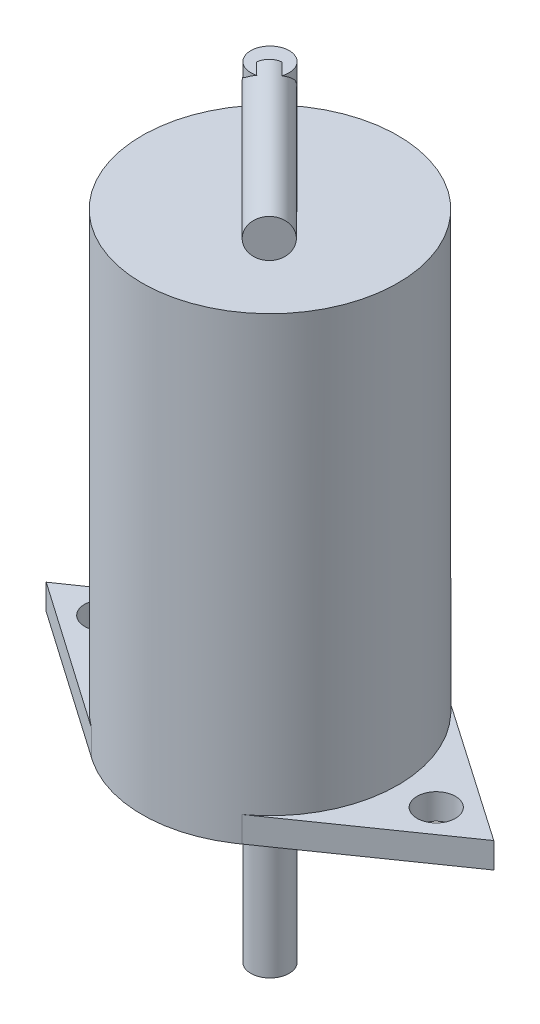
ISO-10303-21;
HEADER;
FILE_DESCRIPTION(('STEP AP214'),'2;1');
FILE_NAME('part.step','',(''),(''),'','','');
FILE_SCHEMA(('AUTOMOTIVE_DESIGN { 1 0 10303 214 1 1 1 1 }'));
ENDSEC;
DATA;
#1=APPLICATION_CONTEXT('core data for automotive mechanical design processes');
#2=APPLICATION_PROTOCOL_DEFINITION('international standard','automotive_design',2000,#1);
#3=PRODUCT_CONTEXT('',#1,'mechanical');
#4=PRODUCT('Part','Part','',(#3));
#5=PRODUCT_RELATED_PRODUCT_CATEGORY('part','',(#4));
#6=PRODUCT_DEFINITION_FORMATION('','',#4);
#7=PRODUCT_DEFINITION_CONTEXT('part definition',#1,'design');
#8=PRODUCT_DEFINITION('design','',#6,#7);
#9=PRODUCT_DEFINITION_SHAPE('','',#8);
#10=(LENGTH_UNIT() NAMED_UNIT(*) SI_UNIT(.MILLI.,.METRE.));
#11=(NAMED_UNIT(*) PLANE_ANGLE_UNIT() SI_UNIT($,.RADIAN.));
#12=(NAMED_UNIT(*) SI_UNIT($,.STERADIAN.) SOLID_ANGLE_UNIT());
#13=UNCERTAINTY_MEASURE_WITH_UNIT(LENGTH_MEASURE(1.E-05),#10,'distance_accuracy_value','');
#14=(GEOMETRIC_REPRESENTATION_CONTEXT(3) GLOBAL_UNCERTAINTY_ASSIGNED_CONTEXT((#13)) GLOBAL_UNIT_ASSIGNED_CONTEXT((#10,
#11,#12)) REPRESENTATION_CONTEXT('',''));
#15=CARTESIAN_POINT('',(0.,0.,0.));
#16=DIRECTION('',(0.,0.,1.));
#17=DIRECTION('',(1.,0.,0.));
#18=AXIS2_PLACEMENT_3D('',#15,#16,#17);
#19=CARTESIAN_POINT('',(0.,36.,0.));
#20=DIRECTION('',(0.,-1.,0.));
#21=DIRECTION('',(0.,0.,-1.));
#22=AXIS2_PLACEMENT_3D('',#19,#20,#21);
#23=CYLINDRICAL_SURFACE('',#22,10.);
#24=CARTESIAN_POINT('',(0.,2.,0.));
#25=DIRECTION('',(0.,-1.,0.));
#26=DIRECTION('',(0.,0.,-1.));
#27=AXIS2_PLACEMENT_3D('',#24,#25,#26);
#28=CIRCLE('',#27,10.);
#29=CARTESIAN_POINT('',(-5.89041679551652,2.,8.08102654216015));
#30=VERTEX_POINT('',#29);
#31=CARTESIAN_POINT('',(-6.43614728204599,2.,-7.65349646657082));
#32=VERTEX_POINT('',#31);
#33=EDGE_CURVE('E183',#30,#32,#28,.T.);
#34=ORIENTED_EDGE('',*,*,#33,.F.);
#35=DIRECTION('',(0.,-1.,0.));
#36=VECTOR('',#35,1.);
#37=CARTESIAN_POINT('',(-5.89041679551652,36.,8.08102654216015));
#38=LINE('',#37,#36);
#39=CARTESIAN_POINT('',(-5.89041679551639,0.,8.08102654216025));
#40=VERTEX_POINT('',#39);
#41=EDGE_CURVE('E304',#30,#40,#38,.T.);
#42=ORIENTED_EDGE('',*,*,#41,.T.);
#43=CARTESIAN_POINT('',(0.,0.,0.));
#44=DIRECTION('',(0.,1.,0.));
#45=DIRECTION('',(-0.589041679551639,0.,0.808102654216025));
#46=AXIS2_PLACEMENT_3D('',#43,#44,#45);
#47=CIRCLE('',#46,10.);
#48=CARTESIAN_POINT('',(-5.53272807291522,0.,8.33000120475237));
#49=VERTEX_POINT('',#48);
#50=EDGE_CURVE('E198',#40,#49,#47,.T.);
#51=ORIENTED_EDGE('',*,*,#50,.T.);
#52=CARTESIAN_POINT('',(0.,0.,0.));
#53=DIRECTION('',(0.,1.,0.));
#54=DIRECTION('',(0.,0.,1.));
#55=AXIS2_PLACEMENT_3D('',#52,#53,#54);
#56=CIRCLE('',#55,10.);
#57=CARTESIAN_POINT('',(5.53272807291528,0.,8.33000120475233));
#58=VERTEX_POINT('',#57);
#59=EDGE_CURVE('E281',#49,#58,#56,.T.);
#60=ORIENTED_EDGE('',*,*,#59,.T.);
#61=CARTESIAN_POINT('',(0.,0.,0.));
#62=DIRECTION('',(0.,1.,0.));
#63=DIRECTION('',(0.553272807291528,0.,0.833000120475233));
#64=AXIS2_PLACEMENT_3D('',#61,#62,#63);
#65=CIRCLE('',#64,10.);
#66=CARTESIAN_POINT('',(5.89041679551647,0.,8.08102654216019));
#67=VERTEX_POINT('',#66);
#68=EDGE_CURVE('E266',#58,#67,#65,.T.);
#69=ORIENTED_EDGE('',*,*,#68,.T.);
#70=DIRECTION('',(0.,-1.,0.));
#71=VECTOR('',#70,1.);
#72=CARTESIAN_POINT('',(5.89041679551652,36.,8.08102654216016));
#73=LINE('',#72,#71);
#74=CARTESIAN_POINT('',(5.89041679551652,2.,8.08102654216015));
#75=VERTEX_POINT('',#74);
#76=EDGE_CURVE('E306',#67,#75,#73,.F.);
#77=ORIENTED_EDGE('',*,*,#76,.T.);
#78=CARTESIAN_POINT('',(6.436147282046,2.,-7.65349646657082));
#79=VERTEX_POINT('',#78);
#80=EDGE_CURVE('E282',#79,#75,#28,.T.);
#81=ORIENTED_EDGE('',*,*,#80,.F.);
#82=DIRECTION('',(0.,-1.,0.));
#83=VECTOR('',#82,1.);
#84=CARTESIAN_POINT('',(6.43614728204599,36.,-7.65349646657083));
#85=LINE('',#84,#83);
#86=CARTESIAN_POINT('',(6.43614728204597,0.,-7.65349646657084));
#87=VERTEX_POINT('',#86);
#88=EDGE_CURVE('E319',#79,#87,#85,.T.);
#89=ORIENTED_EDGE('',*,*,#88,.T.);
#90=CARTESIAN_POINT('',(-6.43614728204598,0.,-7.65349646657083));
#91=VERTEX_POINT('',#90);
#92=EDGE_CURVE('E298',#87,#91,#56,.T.);
#93=ORIENTED_EDGE('',*,*,#92,.T.);
#94=DIRECTION('',(0.,-1.,0.));
#95=VECTOR('',#94,1.);
#96=CARTESIAN_POINT('',(-6.43614728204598,36.,-7.65349646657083));
#97=LINE('',#96,#95);
#98=EDGE_CURVE('E303',#91,#32,#97,.F.);
#99=ORIENTED_EDGE('',*,*,#98,.T.);
#100=EDGE_LOOP('',(#34,#42,#51,#60,#69,#77,#81,#89,#93,#99));
#101=FACE_BOUND('',#100,.T.);
#102=CARTESIAN_POINT('',(0.,36.,0.));
#103=DIRECTION('',(0.,1.,0.));
#104=DIRECTION('',(0.,0.,1.));
#105=AXIS2_PLACEMENT_3D('',#102,#103,#104);
#106=CIRCLE('',#105,10.);
#107=CARTESIAN_POINT('',(0.,36.,10.));
#108=VERTEX_POINT('',#107);
#109=EDGE_CURVE('E188',#108,#108,#106,.T.);
#110=ORIENTED_EDGE('',*,*,#109,.F.);
#111=EDGE_LOOP('',(#110));
#112=FACE_BOUND('',#111,.T.);
#113=CARTESIAN_POINT('',(-6.00309288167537,9.9995188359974,-7.99767940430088));
#114=CARTESIAN_POINT('',(-6.00309628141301,9.91571641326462,-7.99767793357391));
#115=CARTESIAN_POINT('',(-6.00879085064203,9.83186546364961,-7.99341227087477));
#116=CARTESIAN_POINT('',(-6.03135233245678,9.66650562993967,-7.97640150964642));
#117=CARTESIAN_POINT('',(-6.04823009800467,9.58499910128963,-7.96364817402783));
#118=CARTESIAN_POINT('',(-6.09246023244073,9.42674320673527,-7.92986113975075));
#119=CARTESIAN_POINT('',(-6.11980504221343,9.34999045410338,-7.90883341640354));
#120=CARTESIAN_POINT('',(-6.18389359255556,9.20332456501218,-7.85882335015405));
#121=CARTESIAN_POINT('',(-6.22063599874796,9.13341045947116,-7.82984213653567));
#122=CARTESIAN_POINT('',(-6.30240479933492,9.00190178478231,-7.76417752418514));
#123=CARTESIAN_POINT('',(-6.34748194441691,8.94036242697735,-7.72744673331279));
#124=CARTESIAN_POINT('',(-6.44413520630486,8.82782925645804,-7.64702986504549));
#125=CARTESIAN_POINT('',(-6.49571163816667,8.77683595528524,-7.60334345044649));
#126=CARTESIAN_POINT('',(-6.60377492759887,8.68666244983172,-7.50967913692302));
#127=CARTESIAN_POINT('',(-6.66027959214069,8.64752758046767,-7.45967810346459));
#128=CARTESIAN_POINT('',(-6.77611941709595,8.58247729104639,-7.35461167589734));
#129=CARTESIAN_POINT('',(-6.83545442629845,8.55656116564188,-7.29954655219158));
#130=CARTESIAN_POINT('',(-6.9545826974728,8.51886350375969,-7.18613177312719));
#131=CARTESIAN_POINT('',(-7.01436931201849,8.50697871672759,-7.1278094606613));
#132=CARTESIAN_POINT('',(-7.13300549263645,8.49735070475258,-7.00908504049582));
#133=CARTESIAN_POINT('',(-7.191855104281,8.49960678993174,-6.94868303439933));
#134=CARTESIAN_POINT('',(-7.30654495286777,8.51811533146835,-6.82797824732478));
#135=CARTESIAN_POINT('',(-7.36240316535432,8.53427102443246,-6.76767766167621));
#136=CARTESIAN_POINT('',(-7.47011892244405,8.57995918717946,-6.64859188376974));
#137=CARTESIAN_POINT('',(-7.52197633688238,8.60949209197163,-6.58980674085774));
#138=CARTESIAN_POINT('',(-7.62074619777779,8.68125093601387,-6.47533598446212));
#139=CARTESIAN_POINT('',(-7.66763331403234,8.72353803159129,-6.41966687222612));
#140=CARTESIAN_POINT('',(-7.75522031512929,8.81956106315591,-6.31358039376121));
#141=CARTESIAN_POINT('',(-7.79591977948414,8.87329777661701,-6.26316338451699));
#142=CARTESIAN_POINT('',(-7.87076374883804,8.9913326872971,-6.16885285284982));
#143=CARTESIAN_POINT('',(-7.90483929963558,9.05573026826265,-6.12502892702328));
#144=CARTESIAN_POINT('',(-7.96535435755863,9.19292499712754,-6.0461235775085));
#145=CARTESIAN_POINT('',(-7.99179386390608,9.26572214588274,-6.01104215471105));
#146=CARTESIAN_POINT('',(-8.03661106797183,9.41766919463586,-5.95099092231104));
#147=CARTESIAN_POINT('',(-8.05499107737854,9.49681726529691,-5.92601821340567));
#148=CARTESIAN_POINT('',(-8.08341291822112,9.65922973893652,-5.88719119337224));
#149=CARTESIAN_POINT('',(-8.09345541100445,9.74249381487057,-5.87333600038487));
#150=CARTESIAN_POINT('',(-8.10498541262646,9.90979848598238,-5.85741482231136));
#151=CARTESIAN_POINT('',(-8.10656534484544,9.99382061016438,-5.85522147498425));
#152=CARTESIAN_POINT('',(-8.10139624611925,10.16111183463,-5.86237132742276));
#153=CARTESIAN_POINT('',(-8.09464749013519,10.2443809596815,-5.87171414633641));
#154=CARTESIAN_POINT('',(-8.07298301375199,10.4073587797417,-5.90146401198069));
#155=CARTESIAN_POINT('',(-8.05811018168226,10.4870838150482,-5.92181295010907));
#156=CARTESIAN_POINT('',(-8.0204507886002,10.6412284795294,-5.97271844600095));
#157=CARTESIAN_POINT('',(-7.9976637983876,10.7156478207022,-6.00327555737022));
#158=CARTESIAN_POINT('',(-7.94429361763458,10.8577665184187,-6.07372712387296));
#159=CARTESIAN_POINT('',(-7.91364550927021,10.9254030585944,-6.1136990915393));
#160=CARTESIAN_POINT('',(-7.84513994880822,11.051389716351,-6.20136001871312));
#161=CARTESIAN_POINT('',(-7.8072820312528,11.1097392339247,-6.24904947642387));
#162=CARTESIAN_POINT('',(-7.72461368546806,11.2160673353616,-6.35095908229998));
#163=CARTESIAN_POINT('',(-7.67973980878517,11.2639406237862,-6.40523770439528));
#164=CARTESIAN_POINT('',(-7.58419489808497,11.3472262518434,-6.51808606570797));
#165=CARTESIAN_POINT('',(-7.53352400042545,11.3826388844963,-6.57665570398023));
#166=CARTESIAN_POINT('',(-7.42769317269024,11.4398600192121,-6.69594693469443));
#167=CARTESIAN_POINT('',(-7.37254856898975,11.4617129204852,-6.7566608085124));
#168=CARTESIAN_POINT('',(-7.2590155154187,11.4913239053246,-6.87848981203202));
#169=CARTESIAN_POINT('',(-7.20062729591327,11.4990829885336,-6.9396049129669));
#170=CARTESIAN_POINT('',(-7.08286634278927,11.5002524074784,-7.05974543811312));
#171=CARTESIAN_POINT('',(-7.02351069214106,11.4938145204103,-7.1187861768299));
#172=CARTESIAN_POINT('',(-6.90497083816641,11.4670883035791,-7.23382342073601));
#173=CARTESIAN_POINT('',(-6.8457866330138,11.4468001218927,-7.28981995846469));
#174=CARTESIAN_POINT('',(-6.72955446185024,11.3930291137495,-7.39725307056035));
#175=CARTESIAN_POINT('',(-6.67250247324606,11.3595726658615,-7.44869851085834));
#176=CARTESIAN_POINT('',(-6.56225507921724,11.2804288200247,-7.54600697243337));
#177=CARTESIAN_POINT('',(-6.50905978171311,11.2347410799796,-7.59186983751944));
#178=CARTESIAN_POINT('',(-6.40786392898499,11.1319597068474,-7.67748123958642));
#179=CARTESIAN_POINT('',(-6.35991316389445,11.0747693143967,-7.71717246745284));
#180=CARTESIAN_POINT('',(-6.27143679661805,10.9508108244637,-7.78924549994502));
#181=CARTESIAN_POINT('',(-6.23091295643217,10.8840404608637,-7.82162557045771));
#182=CARTESIAN_POINT('',(-6.15857713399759,10.7423338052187,-7.87870995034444));
#183=CARTESIAN_POINT('',(-6.12682121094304,10.6673490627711,-7.90336499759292));
#184=CARTESIAN_POINT('',(-6.07363397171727,10.5117129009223,-7.9443128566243));
#185=CARTESIAN_POINT('',(-6.05219206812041,10.431067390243,-7.96061424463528));
#186=CARTESIAN_POINT('',(-6.02532305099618,10.2916416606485,-7.9809563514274));
#187=CARTESIAN_POINT('',(-6.01700368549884,10.2337168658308,-7.98722201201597));
#188=CARTESIAN_POINT('',(-6.00588744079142,10.1170422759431,-7.99558402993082));
#189=CARTESIAN_POINT('',(-6.00309049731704,10.0582924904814,-7.99768043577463));
#190=CARTESIAN_POINT('',(-6.00309288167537,9.9995188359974,-7.99767940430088));
#191=B_SPLINE_CURVE_WITH_KNOTS('',3,(#113,#114,#115,#116,#117,#118,#119,#120,#121,#122,#123,
#124,#125,#126,#127,#128,#129,#130,#131,#132,#133,#134,#135,#136,#137,#138,#139,#140,#141,#142,
#143,#144,#145,#146,#147,#148,#149,#150,#151,#152,#153,#154,#155,#156,#157,#158,#159,#160,#161,
#162,#163,#164,#165,#166,#167,#168,#169,#170,#171,#172,#173,#174,#175,#176,#177,#178,#179,#180,
#181,#182,#183,#184,#185,#186,#187,#188,#189,#190),.UNSPECIFIED.,.T.,.F.,(4,2,2,2,2,2,2,2,2,2,2,
2,2,2,2,2,2,2,2,2,2,2,2,2,2,2,2,2,2,2,2,2,2,2,2,2,2,2,4),(0.,0.251192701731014,
0.502629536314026,0.75388512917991,1.0051050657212,1.25790832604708,1.51072384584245,
1.76449403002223,2.01825067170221,2.27012815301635,2.52199334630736,2.77211921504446,
3.02225321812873,3.27360621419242,3.52497628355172,3.77883734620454,4.03269843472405,
4.28648666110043,4.54025475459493,4.791245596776,5.04222815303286,5.29189835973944,
5.54158210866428,5.79339816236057,6.04523047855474,6.29948820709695,6.5537399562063,
6.80715474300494,7.06055155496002,7.31125249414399,7.56195075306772,7.81214935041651,
8.06235494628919,8.31476059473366,8.56722604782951,8.82127015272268,9.07505291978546,
9.25122545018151,9.42739593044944),.UNSPECIFIED.);
#192=CARTESIAN_POINT('',(-6.00309288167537,9.9995188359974,-7.99767940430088));
#193=VERTEX_POINT('',#192);
#194=EDGE_CURVE('E191',#193,#193,#191,.T.);
#195=ORIENTED_EDGE('',*,*,#194,.F.);
#196=EDGE_LOOP('',(#195));
#197=FACE_BOUND('',#196,.T.);
#198=ADVANCED_FACE('F41',(#101,#112,#197),#23,.T.);
#199=CARTESIAN_POINT('',(0.,36.,0.));
#200=DIRECTION('',(0.,1.,0.));
#201=DIRECTION('',(0.,0.,1.));
#202=AXIS2_PLACEMENT_3D('',#199,#200,#201);
#203=PLANE('',#202);
#204=CARTESIAN_POINT('',(0.,36.,0.));
#205=DIRECTION('',(0.,1.,0.));
#206=DIRECTION('',(0.,0.,1.));
#207=AXIS2_PLACEMENT_3D('',#204,#205,#206);
#208=CIRCLE('',#207,1.5);
#209=CARTESIAN_POINT('',(0.,36.,1.5));
#210=VERTEX_POINT('',#209);
#211=EDGE_CURVE('E127',#210,#210,#208,.T.);
#212=ORIENTED_EDGE('',*,*,#211,.F.);
#213=EDGE_LOOP('',(#212));
#214=FACE_BOUND('',#213,.T.);
#215=ORIENTED_EDGE('',*,*,#109,.T.);
#216=EDGE_LOOP('',(#215));
#217=FACE_BOUND('',#216,.T.);
#218=ADVANCED_FACE('F171',(#214,#217),#203,.T.);
#219=CARTESIAN_POINT('',(0.,0.,0.));
#220=DIRECTION('',(0.,1.,0.));
#221=DIRECTION('',(0.,0.,1.));
#222=AXIS2_PLACEMENT_3D('',#219,#220,#221);
#223=PLANE('',#222);
#224=CARTESIAN_POINT('',(0.,0.,0.));
#225=DIRECTION('',(0.,1.,0.));
#226=DIRECTION('',(0.,0.,1.));
#227=AXIS2_PLACEMENT_3D('',#224,#225,#226);
#228=CIRCLE('',#227,1.5);
#229=CARTESIAN_POINT('',(0.,0.,1.5));
#230=VERTEX_POINT('',#229);
#231=EDGE_CURVE('E193',#230,#230,#228,.F.);
#232=ORIENTED_EDGE('',*,*,#231,.F.);
#233=EDGE_LOOP('',(#232));
#234=FACE_BOUND('',#233,.T.);
#235=CARTESIAN_POINT('',(-13.,0.,0.));
#236=DIRECTION('',(0.,-1.,0.));
#237=DIRECTION('',(0.,0.,-1.));
#238=AXIS2_PLACEMENT_3D('',#235,#236,#237);
#239=CIRCLE('',#238,1.5);
#240=CARTESIAN_POINT('',(-13.,0.,-1.5));
#241=VERTEX_POINT('',#240);
#242=EDGE_CURVE('E346',#241,#241,#239,.T.);
#243=ORIENTED_EDGE('',*,*,#242,.F.);
#244=EDGE_LOOP('',(#243));
#245=FACE_BOUND('',#244,.T.);
#246=CARTESIAN_POINT('',(13.,0.,0.));
#247=DIRECTION('',(0.,-1.,0.));
#248=DIRECTION('',(0.,0.,-1.));
#249=AXIS2_PLACEMENT_3D('',#246,#247,#248);
#250=CIRCLE('',#249,1.5);
#251=CARTESIAN_POINT('',(13.,0.,-1.5));
#252=VERTEX_POINT('',#251);
#253=EDGE_CURVE('E342',#252,#252,#250,.T.);
#254=ORIENTED_EDGE('',*,*,#253,.F.);
#255=EDGE_LOOP('',(#254));
#256=FACE_BOUND('',#255,.T.);
#257=ORIENTED_EDGE('',*,*,#92,.F.);
#258=DIRECTION('',(0.822404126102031,0.,0.56890372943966));
#259=VECTOR('',#258,1.);
#260=CARTESIAN_POINT('',(17.5,0.,0.));
#261=LINE('',#260,#259);
#262=CARTESIAN_POINT('',(17.5,0.,0.));
#263=VERTEX_POINT('',#262);
#264=EDGE_CURVE('E328',#87,#263,#261,.T.);
#265=ORIENTED_EDGE('',*,*,#264,.T.);
#266=DIRECTION('',(-0.82074626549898,0.,0.571292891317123));
#267=VECTOR('',#266,1.);
#268=CARTESIAN_POINT('',(5.53272807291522,0.,8.33000120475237));
#269=LINE('',#268,#267);
#270=EDGE_CURVE('E330',#263,#67,#269,.T.);
#271=ORIENTED_EDGE('',*,*,#270,.T.);
#272=ORIENTED_EDGE('',*,*,#68,.F.);
#273=ORIENTED_EDGE('',*,*,#59,.F.);
#274=ORIENTED_EDGE('',*,*,#50,.F.);
#275=DIRECTION('',(-0.82074626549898,0.,-0.571292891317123));
#276=VECTOR('',#275,1.);
#277=CARTESIAN_POINT('',(-17.5,0.,0.));
#278=LINE('',#277,#276);
#279=CARTESIAN_POINT('',(-17.5,0.,0.));
#280=VERTEX_POINT('',#279);
#281=EDGE_CURVE('E279',#40,#280,#278,.T.);
#282=ORIENTED_EDGE('',*,*,#281,.T.);
#283=DIRECTION('',(0.822404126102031,0.,-0.56890372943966));
#284=VECTOR('',#283,1.);
#285=CARTESIAN_POINT('',(-4.89165358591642,0.,-8.72191063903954));
#286=LINE('',#285,#284);
#287=EDGE_CURVE('E331',#280,#91,#286,.T.);
#288=ORIENTED_EDGE('',*,*,#287,.T.);
#289=EDGE_LOOP('',(#257,#265,#271,#272,#273,#274,#282,#288));
#290=FACE_BOUND('',#289,.T.);
#291=ADVANCED_FACE('F177',(#234,#245,#256,#290),#223,.F.);
#292=CARTESIAN_POINT('',(0.,2.,0.));
#293=DIRECTION('',(0.,-1.,0.));
#294=DIRECTION('',(0.,0.,-1.));
#295=AXIS2_PLACEMENT_3D('',#292,#293,#294);
#296=PLANE('',#295);
#297=CARTESIAN_POINT('',(-13.,2.,0.));
#298=DIRECTION('',(0.,-1.,0.));
#299=DIRECTION('',(0.,0.,-1.));
#300=AXIS2_PLACEMENT_3D('',#297,#298,#299);
#301=CIRCLE('',#300,1.5);
#302=CARTESIAN_POINT('',(-13.,2.,-1.5));
#303=VERTEX_POINT('',#302);
#304=EDGE_CURVE('E333',#303,#303,#301,.T.);
#305=ORIENTED_EDGE('',*,*,#304,.T.);
#306=EDGE_LOOP('',(#305));
#307=FACE_BOUND('',#306,.T.);
#308=DIRECTION('',(-0.82074626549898,0.,-0.571292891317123));
#309=VECTOR('',#308,1.);
#310=CARTESIAN_POINT('',(-17.5,2.,0.));
#311=LINE('',#310,#309);
#312=CARTESIAN_POINT('',(-17.5,2.,0.));
#313=VERTEX_POINT('',#312);
#314=EDGE_CURVE('E312',#30,#313,#311,.T.);
#315=ORIENTED_EDGE('',*,*,#314,.F.);
#316=ORIENTED_EDGE('',*,*,#33,.T.);
#317=DIRECTION('',(0.822404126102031,0.,-0.56890372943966));
#318=VECTOR('',#317,1.);
#319=CARTESIAN_POINT('',(-4.89165358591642,2.,-8.72191063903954));
#320=LINE('',#319,#318);
#321=EDGE_CURVE('E336',#313,#32,#320,.T.);
#322=ORIENTED_EDGE('',*,*,#321,.F.);
#323=EDGE_LOOP('',(#315,#316,#322));
#324=FACE_BOUND('',#323,.T.);
#325=ADVANCED_FACE('F239',(#307,#324),#296,.F.);
#326=CARTESIAN_POINT('',(13.,2.,0.));
#327=DIRECTION('',(0.,-1.,0.));
#328=DIRECTION('',(0.,0.,-1.));
#329=AXIS2_PLACEMENT_3D('',#326,#327,#328);
#330=CIRCLE('',#329,1.5);
#331=CARTESIAN_POINT('',(13.,2.,-1.5));
#332=VERTEX_POINT('',#331);
#333=EDGE_CURVE('E339',#332,#332,#330,.T.);
#334=ORIENTED_EDGE('',*,*,#333,.T.);
#335=EDGE_LOOP('',(#334));
#336=FACE_BOUND('',#335,.T.);
#337=ORIENTED_EDGE('',*,*,#80,.T.);
#338=DIRECTION('',(-0.82074626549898,0.,0.571292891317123));
#339=VECTOR('',#338,1.);
#340=CARTESIAN_POINT('',(5.53272807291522,2.,8.33000120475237));
#341=LINE('',#340,#339);
#342=CARTESIAN_POINT('',(17.5,2.,0.));
#343=VERTEX_POINT('',#342);
#344=EDGE_CURVE('E315',#343,#75,#341,.T.);
#345=ORIENTED_EDGE('',*,*,#344,.F.);
#346=DIRECTION('',(0.822404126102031,0.,0.56890372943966));
#347=VECTOR('',#346,1.);
#348=CARTESIAN_POINT('',(17.5,2.,0.));
#349=LINE('',#348,#347);
#350=EDGE_CURVE('E334',#79,#343,#349,.T.);
#351=ORIENTED_EDGE('',*,*,#350,.F.);
#352=EDGE_LOOP('',(#337,#345,#351));
#353=FACE_BOUND('',#352,.T.);
#354=ADVANCED_FACE('F234',(#336,#353),#296,.F.);
#355=CARTESIAN_POINT('',(17.5,2.,0.));
#356=DIRECTION('',(0.56890372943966,0.,-0.822404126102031));
#357=DIRECTION('',(-0.822404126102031,0.,-0.56890372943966));
#358=AXIS2_PLACEMENT_3D('',#355,#356,#357);
#359=PLANE('',#358);
#360=ORIENTED_EDGE('',*,*,#88,.F.);
#361=ORIENTED_EDGE('',*,*,#350,.T.);
#362=DIRECTION('',(0.,-1.,0.));
#363=VECTOR('',#362,1.);
#364=CARTESIAN_POINT('',(17.5,2.,0.));
#365=LINE('',#364,#363);
#366=EDGE_CURVE('E314',#343,#263,#365,.T.);
#367=ORIENTED_EDGE('',*,*,#366,.T.);
#368=ORIENTED_EDGE('',*,*,#264,.F.);
#369=EDGE_LOOP('',(#360,#361,#367,#368));
#370=FACE_BOUND('',#369,.T.);
#371=ADVANCED_FACE('F230',(#370),#359,.T.);
#372=CARTESIAN_POINT('',(5.53272807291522,2.,8.33000120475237));
#373=DIRECTION('',(0.571292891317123,0.,0.82074626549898));
#374=DIRECTION('',(0.82074626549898,0.,-0.571292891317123));
#375=AXIS2_PLACEMENT_3D('',#372,#373,#374);
#376=PLANE('',#375);
#377=ORIENTED_EDGE('',*,*,#76,.F.);
#378=ORIENTED_EDGE('',*,*,#270,.F.);
#379=ORIENTED_EDGE('',*,*,#366,.F.);
#380=ORIENTED_EDGE('',*,*,#344,.T.);
#381=EDGE_LOOP('',(#377,#378,#379,#380));
#382=FACE_BOUND('',#381,.T.);
#383=ADVANCED_FACE('F227',(#382),#376,.T.);
#384=CARTESIAN_POINT('',(-4.89165358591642,2.,-8.72191063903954));
#385=DIRECTION('',(-0.56890372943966,0.,-0.822404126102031));
#386=DIRECTION('',(-0.822404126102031,0.,0.56890372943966));
#387=AXIS2_PLACEMENT_3D('',#384,#385,#386);
#388=PLANE('',#387);
#389=ORIENTED_EDGE('',*,*,#98,.F.);
#390=ORIENTED_EDGE('',*,*,#287,.F.);
#391=DIRECTION('',(0.,-1.,0.));
#392=VECTOR('',#391,1.);
#393=CARTESIAN_POINT('',(-17.5,2.,0.));
#394=LINE('',#393,#392);
#395=EDGE_CURVE('E324',#313,#280,#394,.T.);
#396=ORIENTED_EDGE('',*,*,#395,.F.);
#397=ORIENTED_EDGE('',*,*,#321,.T.);
#398=EDGE_LOOP('',(#389,#390,#396,#397));
#399=FACE_BOUND('',#398,.T.);
#400=ADVANCED_FACE('F225',(#399),#388,.T.);
#401=CARTESIAN_POINT('',(-17.5,2.,0.));
#402=DIRECTION('',(-0.571292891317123,0.,0.82074626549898));
#403=DIRECTION('',(0.82074626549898,0.,0.571292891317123));
#404=AXIS2_PLACEMENT_3D('',#401,#402,#403);
#405=PLANE('',#404);
#406=ORIENTED_EDGE('',*,*,#41,.F.);
#407=ORIENTED_EDGE('',*,*,#314,.T.);
#408=ORIENTED_EDGE('',*,*,#395,.T.);
#409=ORIENTED_EDGE('',*,*,#281,.F.);
#410=EDGE_LOOP('',(#406,#407,#408,#409));
#411=FACE_BOUND('',#410,.T.);
#412=ADVANCED_FACE('F221',(#411),#405,.T.);
#413=CARTESIAN_POINT('',(13.,2.,0.));
#414=DIRECTION('',(0.,-1.,0.));
#415=DIRECTION('',(0.,0.,-1.));
#416=AXIS2_PLACEMENT_3D('',#413,#414,#415);
#417=CYLINDRICAL_SURFACE('',#416,1.5);
#418=ORIENTED_EDGE('',*,*,#333,.F.);
#419=EDGE_LOOP('',(#418));
#420=FACE_BOUND('',#419,.T.);
#421=ORIENTED_EDGE('',*,*,#253,.T.);
#422=EDGE_LOOP('',(#421));
#423=FACE_BOUND('',#422,.T.);
#424=ADVANCED_FACE('F217',(#420,#423),#417,.F.);
#425=CARTESIAN_POINT('',(-13.,2.,0.));
#426=DIRECTION('',(0.,-1.,0.));
#427=DIRECTION('',(0.,0.,-1.));
#428=AXIS2_PLACEMENT_3D('',#425,#426,#427);
#429=CYLINDRICAL_SURFACE('',#428,1.5);
#430=ORIENTED_EDGE('',*,*,#304,.F.);
#431=EDGE_LOOP('',(#430));
#432=FACE_BOUND('',#431,.T.);
#433=ORIENTED_EDGE('',*,*,#242,.T.);
#434=EDGE_LOOP('',(#433));
#435=FACE_BOUND('',#434,.T.);
#436=ADVANCED_FACE('F213',(#432,#435),#429,.F.);
#437=CARTESIAN_POINT('',(0.,-15.,0.));
#438=DIRECTION('',(0.,1.,0.));
#439=DIRECTION('',(0.,0.,1.));
#440=AXIS2_PLACEMENT_3D('',#437,#438,#439);
#441=CYLINDRICAL_SURFACE('',#440,1.5);
#442=CARTESIAN_POINT('',(0.,-15.,0.));
#443=DIRECTION('',(0.,-1.,0.));
#444=DIRECTION('',(0.,0.,-1.));
#445=AXIS2_PLACEMENT_3D('',#442,#443,#444);
#446=CIRCLE('',#445,1.5);
#447=CARTESIAN_POINT('',(0.,-15.,-1.5));
#448=VERTEX_POINT('',#447);
#449=EDGE_CURVE('E343',#448,#448,#446,.T.);
#450=ORIENTED_EDGE('',*,*,#449,.F.);
#451=EDGE_LOOP('',(#450));
#452=FACE_BOUND('',#451,.T.);
#453=ORIENTED_EDGE('',*,*,#231,.T.);
#454=EDGE_LOOP('',(#453));
#455=FACE_BOUND('',#454,.T.);
#456=ADVANCED_FACE('F209',(#452,#455),#441,.T.);
#457=CARTESIAN_POINT('',(0.,-15.,0.));
#458=DIRECTION('',(0.,-1.,0.));
#459=DIRECTION('',(0.,0.,-1.));
#460=AXIS2_PLACEMENT_3D('',#457,#458,#459);
#461=PLANE('',#460);
#462=ORIENTED_EDGE('',*,*,#449,.T.);
#463=EDGE_LOOP('',(#462));
#464=FACE_BOUND('',#463,.T.);
#465=ADVANCED_FACE('F207',(#464),#461,.T.);
#466=CARTESIAN_POINT('',(-10.704247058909,10.0091163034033,-10.5775132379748));
#467=DIRECTION('',(0.707105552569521,-0.00186414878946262,0.707105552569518));
#468=DIRECTION('',(0.707106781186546,0.,-0.707106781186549));
#469=AXIS2_PLACEMENT_3D('',#466,#467,#468);
#470=CYLINDRICAL_SURFACE('',#469,1.5);
#471=ORIENTED_EDGE('',*,*,#194,.T.);
#472=EDGE_LOOP('',(#471));
#473=FACE_BOUND('',#472,.T.);
#474=CARTESIAN_POINT('',(-16.3610914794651,10.024029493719,-16.234357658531));
#475=DIRECTION('',(-0.707105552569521,0.00186414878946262,-0.707105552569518));
#476=DIRECTION('',(-0.707106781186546,0.,0.707106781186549));
#477=AXIS2_PLACEMENT_3D('',#474,#475,#476);
#478=CIRCLE('',#477,1.5);
#479=CARTESIAN_POINT('',(-17.421751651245,10.024029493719,-15.1736974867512));
#480=VERTEX_POINT('',#479);
#481=EDGE_CURVE('E353',#480,#480,#478,.T.);
#482=ORIENTED_EDGE('',*,*,#481,.F.);
#483=EDGE_LOOP('',(#482));
#484=FACE_BOUND('',#483,.T.);
#485=ADVANCED_FACE('F169',(#473,#484),#470,.T.);
#486=CARTESIAN_POINT('',(0.,46.,0.));
#487=DIRECTION('',(0.,-1.,0.));
#488=DIRECTION('',(0.,0.,-1.));
#489=AXIS2_PLACEMENT_3D('',#486,#487,#488);
#490=CYLINDRICAL_SURFACE('',#489,1.5);
#491=CARTESIAN_POINT('',(0.,46.,0.));
#492=DIRECTION('',(0.,1.,0.));
#493=DIRECTION('',(0.,0.,1.));
#494=AXIS2_PLACEMENT_3D('',#491,#492,#493);
#495=CIRCLE('',#494,1.5);
#496=CARTESIAN_POINT('',(1.41544702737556,46.,0.496497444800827));
#497=VERTEX_POINT('',#496);
#498=CARTESIAN_POINT('',(0.407580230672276,46.,1.44356446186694));
#499=VERTEX_POINT('',#498);
#500=EDGE_CURVE('E120',#497,#499,#495,.T.);
#501=ORIENTED_EDGE('',*,*,#500,.F.);
#502=CARTESIAN_POINT('',(1.41544702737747,46.,0.496497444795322));
#503=CARTESIAN_POINT('',(1.43020866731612,45.9791620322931,0.454403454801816));
#504=CARTESIAN_POINT('',(1.44284383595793,45.9568314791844,0.412382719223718));
#505=CARTESIAN_POINT('',(1.46413580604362,45.9096176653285,0.328879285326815));
#506=CARTESIAN_POINT('',(1.47280061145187,45.8847396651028,0.287395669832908));
#507=CARTESIAN_POINT('',(1.49323705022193,45.8071295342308,0.164610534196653));
#508=CARTESIAN_POINT('',(1.49963291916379,45.7511426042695,0.0844244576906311));
#509=CARTESIAN_POINT('',(1.50021080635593,45.6541221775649,-0.0431343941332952));
#510=CARTESIAN_POINT('',(1.49794496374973,45.6149085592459,-0.0919796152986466));
#511=CARTESIAN_POINT('',(1.48902043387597,45.5342460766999,-0.187372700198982));
#512=CARTESIAN_POINT('',(1.4823624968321,45.4927975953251,-0.233920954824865));
#513=CARTESIAN_POINT('',(1.46522298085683,45.4078439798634,-0.324415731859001));
#514=CARTESIAN_POINT('',(1.45473801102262,45.3643370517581,-0.368359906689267));
#515=CARTESIAN_POINT('',(1.43057593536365,45.2752418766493,-0.453201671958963));
#516=CARTESIAN_POINT('',(1.41689762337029,45.229652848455,-0.494098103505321));
#517=CARTESIAN_POINT('',(1.39129306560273,45.1486063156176,-0.561453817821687));
#518=CARTESIAN_POINT('',(1.3798920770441,45.1137397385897,-0.588828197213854));
#519=CARTESIAN_POINT('',(1.35652753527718,45.0422118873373,-0.640809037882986));
#520=CARTESIAN_POINT('',(1.34456485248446,45.0055533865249,-0.665419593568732));
#521=CARTESIAN_POINT('',(1.32445806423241,44.939655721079,-0.704383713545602));
#522=CARTESIAN_POINT('',(1.316148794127,44.9110564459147,-0.719719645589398));
#523=CARTESIAN_POINT('',(1.30096743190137,44.8518247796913,-0.746807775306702));
#524=CARTESIAN_POINT('',(1.29409072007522,44.8211993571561,-0.758571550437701));
#525=CARTESIAN_POINT('',(1.2854778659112,44.7691410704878,-0.773040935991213));
#526=CARTESIAN_POINT('',(1.28278224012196,44.7483748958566,-0.777483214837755));
#527=CARTESIAN_POINT('',(1.27927304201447,44.7062837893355,-0.783245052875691));
#528=CARTESIAN_POINT('',(1.27845402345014,44.6849606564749,-0.784573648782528));
#529=CARTESIAN_POINT('',(1.27889086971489,44.6423577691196,-0.783860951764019));
#530=CARTESIAN_POINT('',(1.28015059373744,44.6210781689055,-0.781813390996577));
#531=CARTESIAN_POINT('',(1.28444308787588,44.5791829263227,-0.774740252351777));
#532=CARTESIAN_POINT('',(1.28748091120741,44.5585693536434,-0.769706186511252));
#533=CARTESIAN_POINT('',(1.29756675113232,44.5027126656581,-0.752645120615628));
#534=CARTESIAN_POINT('',(1.30589975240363,44.4684707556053,-0.738220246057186));
#535=CARTESIAN_POINT('',(1.32394627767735,44.4023237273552,-0.70535515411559));
#536=CARTESIAN_POINT('',(1.33366702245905,44.3704322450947,-0.686893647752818));
#537=CARTESIAN_POINT('',(1.35912585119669,44.2896162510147,-0.635616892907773));
#538=CARTESIAN_POINT('',(1.37496842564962,44.2419770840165,-0.60084444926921));
#539=CARTESIAN_POINT('',(1.40483160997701,44.149236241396,-0.527300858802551));
#540=CARTESIAN_POINT('',(1.41884903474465,44.104139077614,-0.488522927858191));
#541=CARTESIAN_POINT('',(1.44410865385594,44.0159423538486,-0.407843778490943));
#542=CARTESIAN_POINT('',(1.45534931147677,43.9728439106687,-0.365940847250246));
#543=CARTESIAN_POINT('',(1.47438187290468,43.8885944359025,-0.279562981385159));
#544=CARTESIAN_POINT('',(1.48217666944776,43.8474417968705,-0.235090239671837));
#545=CARTESIAN_POINT('',(1.49773757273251,43.7398971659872,-0.112883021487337));
#546=CARTESIAN_POINT('',(1.5019030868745,43.6753043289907,-0.0330353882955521));
#547=CARTESIAN_POINT('',(1.49647745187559,43.5535347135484,0.131596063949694));
#548=CARTESIAN_POINT('',(1.48691982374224,43.4963402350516,0.216367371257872));
#549=CARTESIAN_POINT('',(1.45622427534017,43.4062840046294,0.3654153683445));
#550=CARTESIAN_POINT('',(1.43892349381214,43.3710272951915,0.429025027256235));
#551=CARTESIAN_POINT('',(1.39461756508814,43.3074965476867,0.556391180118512));
#552=CARTESIAN_POINT('',(1.36762328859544,43.2792147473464,0.620147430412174));
#553=CARTESIAN_POINT('',(1.30831841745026,43.2350525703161,0.736117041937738));
#554=CARTESIAN_POINT('',(1.27746292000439,43.2179341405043,0.788598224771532));
#555=CARTESIAN_POINT('',(1.20854222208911,43.1909360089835,0.890621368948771));
#556=CARTESIAN_POINT('',(1.17048144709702,43.1810518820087,0.940165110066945));
#557=CARTESIAN_POINT('',(1.08775545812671,43.1691501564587,1.03476934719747));
#558=CARTESIAN_POINT('',(1.04306892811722,43.1671585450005,1.07981455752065));
#559=CARTESIAN_POINT('',(0.948552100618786,43.1711911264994,1.16371963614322));
#560=CARTESIAN_POINT('',(0.898721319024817,43.1772160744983,1.20257892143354));
#561=CARTESIAN_POINT('',(0.798222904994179,43.1962380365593,1.27136319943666));
#562=CARTESIAN_POINT('',(0.747723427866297,43.2088691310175,1.30163925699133));
#563=CARTESIAN_POINT('',(0.645023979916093,43.2400270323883,1.35547471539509));
#564=CARTESIAN_POINT('',(0.592823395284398,43.258555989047,1.37903166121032));
#565=CARTESIAN_POINT('',(0.46776911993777,43.308609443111,1.42731919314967));
#566=CARTESIAN_POINT('',(0.394658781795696,43.3423934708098,1.44904702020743));
#567=CARTESIAN_POINT('',(0.249509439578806,43.4170067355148,1.48097813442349));
#568=CARTESIAN_POINT('',(0.177473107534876,43.457851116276,1.49115628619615));
#569=CARTESIAN_POINT('',(0.0095888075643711,43.5605566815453,1.50312125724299));
#570=CARTESIAN_POINT('',(-0.0852284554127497,43.6246089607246,1.50042111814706));
#571=CARTESIAN_POINT('',(-0.268959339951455,43.7579650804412,1.47859735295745));
#572=CARTESIAN_POINT('',(-0.357867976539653,43.8272732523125,1.45946004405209));
#573=CARTESIAN_POINT('',(-0.507837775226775,43.9493787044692,1.41300911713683));
#574=CARTESIAN_POINT('',(-0.570207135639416,44.0018669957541,1.38903674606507));
#575=CARTESIAN_POINT('',(-0.661981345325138,44.0791046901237,1.34644467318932));
#576=CARTESIAN_POINT('',(-0.692295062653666,44.1046174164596,1.33112972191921));
#577=CARTESIAN_POINT('',(-0.752562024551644,44.1544076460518,1.29801234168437));
#578=CARTESIAN_POINT('',(-0.782515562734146,44.178686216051,1.28021211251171));
#579=CARTESIAN_POINT('',(-0.836118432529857,44.2197484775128,1.24567028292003));
#580=CARTESIAN_POINT('',(-0.85975488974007,44.237028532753,1.22950744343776));
#581=CARTESIAN_POINT('',(-0.90717477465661,44.2684779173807,1.19494292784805));
#582=CARTESIAN_POINT('',(-0.930955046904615,44.2826734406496,1.17656234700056));
#583=CARTESIAN_POINT('',(-0.970595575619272,44.3015791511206,1.14383158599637));
#584=CARTESIAN_POINT('',(-0.986337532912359,44.3078713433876,1.13029928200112));
#585=CARTESIAN_POINT('',(-1.01798869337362,44.3172828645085,1.10189172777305));
#586=CARTESIAN_POINT('',(-1.03389672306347,44.320351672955,1.0869989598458));
#587=CARTESIAN_POINT('',(-1.04963452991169,44.3212775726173,1.07157237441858));
#588=B_SPLINE_CURVE_WITH_KNOTS('',3,(#502,#503,#504,#505,#506,#507,#508,#509,#510,#511,#512,
#513,#514,#515,#516,#517,#518,#519,#520,#521,#522,#523,#524,#525,#526,#527,#528,#529,#530,#531,
#532,#533,#534,#535,#536,#537,#538,#539,#540,#541,#542,#543,#544,#545,#546,#547,#548,#549,#550,
#551,#552,#553,#554,#555,#556,#557,#558,#559,#560,#561,#562,#563,#564,#565,#566,#567,#568,#569,
#570,#571,#572,#573,#574,#575,#576,#577,#578,#579,#580,#581,#582,#583,#584,#585,#586,#587),
.UNSPECIFIED.,.F.,.F.,(4,2,2,2,2,2,2,2,2,2,2,2,2,2,2,2,2,2,2,2,2,2,2,2,2,2,2,2,2,2,2,2,2,2,2,2,
2,2,2,2,2,2,4),(0.,0.147523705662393,0.294748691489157,0.587297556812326,0.775140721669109,
0.962951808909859,1.15092970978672,1.33897872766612,1.47621560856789,1.61324642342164,
1.71360557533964,1.81363590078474,1.87760126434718,1.94138075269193,2.00527878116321,
2.06935929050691,2.18294663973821,2.29714814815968,2.48000063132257,2.66316805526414,
2.8464366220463,3.02955104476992,3.33678244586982,3.64326465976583,3.8667458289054,
4.08997715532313,4.27889332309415,4.46769383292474,4.65711547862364,4.84655496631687,
5.02646612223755,5.20644293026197,5.45531583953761,5.70472933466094,6.0462499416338,
6.38805511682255,6.64247365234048,6.76984712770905,6.89710856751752,6.99732836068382,
7.09666058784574,7.16148770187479,7.22731635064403),.UNSPECIFIED.);
#589=CARTESIAN_POINT('',(-1.04963472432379,44.3212775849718,1.07157218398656));
#590=VERTEX_POINT('',#589);
#591=EDGE_CURVE('E61',#497,#590,#588,.T.);
#592=ORIENTED_EDGE('',*,*,#591,.T.);
#593=CARTESIAN_POINT('',(0.,36.,0.));
#594=DIRECTION('',(-0.707105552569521,0.00186414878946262,-0.707105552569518));
#595=DIRECTION('',(-0.00131815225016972,-0.999998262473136,-0.00131815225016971));
#596=AXIS2_PLACEMENT_3D('',#593,#594,#595);
#597=ELLIPSE('',#596,804.656800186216,1.5);
#598=CARTESIAN_POINT('',(-1.04870225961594,45.0211369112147,1.0724847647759));
#599=VERTEX_POINT('',#598);
#600=EDGE_CURVE('E56',#590,#599,#597,.T.);
#601=ORIENTED_EDGE('',*,*,#600,.T.);
#602=CARTESIAN_POINT('',(-1.04870213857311,45.0211376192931,1.07248464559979));
#603=CARTESIAN_POINT('',(-1.02910027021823,45.0222870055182,1.09166470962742));
#604=CARTESIAN_POINT('',(-1.00931612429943,45.0267222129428,1.10994727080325));
#605=CARTESIAN_POINT('',(-0.970161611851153,45.0402446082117,1.14430839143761));
#606=CARTESIAN_POINT('',(-0.950791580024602,45.0492287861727,1.16042616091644));
#607=CARTESIAN_POINT('',(-0.909369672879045,45.0717612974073,1.19325543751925));
#608=CARTESIAN_POINT('',(-0.887370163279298,45.0858026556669,1.20966819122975));
#609=CARTESIAN_POINT('',(-0.843551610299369,45.1161051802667,1.24061950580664));
#610=CARTESIAN_POINT('',(-0.821732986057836,45.1323704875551,1.25515446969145));
#611=CARTESIAN_POINT('',(-0.755397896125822,45.1836737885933,1.29698066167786));
#612=CARTESIAN_POINT('',(-0.71086273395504,45.220650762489,1.32182660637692));
#613=CARTESIAN_POINT('',(-0.617787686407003,45.2984780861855,1.36791241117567));
#614=CARTESIAN_POINT('',(-0.569172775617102,45.3394254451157,1.38882434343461));
#615=CARTESIAN_POINT('',(-0.47004151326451,45.4214668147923,1.4254310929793));
#616=CARTESIAN_POINT('',(-0.419523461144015,45.4625609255,1.44112111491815));
#617=CARTESIAN_POINT('',(-0.317059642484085,45.5433796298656,1.4670476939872));
#618=CARTESIAN_POINT('',(-0.265138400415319,45.5831147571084,1.47734765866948));
#619=CARTESIAN_POINT('',(-0.159359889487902,45.6609448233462,1.49246735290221));
#620=CARTESIAN_POINT('',(-0.105503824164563,45.6990407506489,1.49729043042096));
#621=CARTESIAN_POINT('',(0.0226166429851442,45.7854043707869,1.50162119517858));
#622=CARTESIAN_POINT('',(0.0976244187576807,45.8327560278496,1.49878024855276));
#623=CARTESIAN_POINT('',(0.212243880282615,45.8992582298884,1.48541409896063));
#624=CARTESIAN_POINT('',(0.251034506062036,45.9207835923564,1.47937878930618));
#625=CARTESIAN_POINT('',(0.329046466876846,45.9619188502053,1.46400464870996));
#626=CARTESIAN_POINT('',(0.368268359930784,45.9815258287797,1.45466088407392));
#627=CARTESIAN_POINT('',(0.40758023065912,45.9999999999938,1.44356446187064));
#628=B_SPLINE_CURVE_WITH_KNOTS('',3,(#602,#603,#604,#605,#606,#607,#608,#609,#610,#611,#612,
#613,#614,#615,#616,#617,#618,#619,#620,#621,#622,#623,#624,#625,#626,#627),.UNSPECIFIED.,.F.,
.F.,(4,2,2,2,2,2,2,2,2,2,2,2,4),(0.,0.0816259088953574,0.161480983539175,0.253777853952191,
0.346248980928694,0.534841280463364,0.735374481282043,0.936091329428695,1.1343906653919,
1.33256871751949,1.59775461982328,1.73192409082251,1.86629448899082),.UNSPECIFIED.);
#629=EDGE_CURVE('E144',#599,#499,#628,.T.);
#630=ORIENTED_EDGE('',*,*,#629,.T.);
#631=EDGE_LOOP('',(#501,#592,#601,#630));
#632=FACE_BOUND('',#631,.T.);
#633=ORIENTED_EDGE('',*,*,#211,.T.);
#634=EDGE_LOOP('',(#633));
#635=FACE_BOUND('',#634,.T.);
#636=ADVANCED_FACE('F150',(#632,#635),#490,.T.);
#637=CARTESIAN_POINT('',(0.,46.,0.));
#638=DIRECTION('',(0.,1.,0.));
#639=DIRECTION('',(0.,0.,1.));
#640=AXIS2_PLACEMENT_3D('',#637,#638,#639);
#641=PLANE('',#640);
#642=CARTESIAN_POINT('',(-504.064156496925,46.,-504.005748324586));
#643=DIRECTION('',(0.,1.,0.));
#644=DIRECTION('',(-0.707106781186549,0.,-0.707106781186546));
#645=AXIS2_PLACEMENT_3D('',#642,#643,#644);
#646=ELLIPSE('',#645,804.656800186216,1.5);
#647=CARTESIAN_POINT('',(-0.508072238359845,46.,0.53443532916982));
#648=VERTEX_POINT('',#647);
#649=EDGE_CURVE('E11',#648,#499,#646,.T.);
#650=ORIENTED_EDGE('',*,*,#649,.F.);
#651=DIRECTION('',(-0.707106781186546,0.,0.707106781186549));
#652=VECTOR('',#651,1.);
#653=CARTESIAN_POINT('',(0.0131815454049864,46.,0.0131815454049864));
#654=LINE('',#653,#652);
#655=CARTESIAN_POINT('',(0.476027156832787,46.,-0.449664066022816));
#656=VERTEX_POINT('',#655);
#657=EDGE_CURVE('E118',#656,#648,#654,.T.);
#658=ORIENTED_EDGE('',*,*,#657,.F.);
#659=EDGE_CURVE('E45',#497,#656,#646,.T.);
#660=ORIENTED_EDGE('',*,*,#659,.F.);
#661=ORIENTED_EDGE('',*,*,#500,.T.);
#662=EDGE_LOOP('',(#650,#658,#660,#661));
#663=FACE_BOUND('',#662,.T.);
#664=ADVANCED_FACE('F117',(#663),#641,.T.);
#665=CARTESIAN_POINT('',(-16.3610914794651,10.024029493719,-16.234357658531));
#666=DIRECTION('',(-0.707105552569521,0.00186414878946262,-0.707105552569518));
#667=DIRECTION('',(-0.707106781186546,0.,0.707106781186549));
#668=AXIS2_PLACEMENT_3D('',#665,#666,#667);
#669=PLANE('',#668);
#670=ORIENTED_EDGE('',*,*,#481,.T.);
#671=EDGE_LOOP('',(#670));
#672=FACE_BOUND('',#671,.T.);
#673=ADVANCED_FACE('F159',(#672),#669,.T.);
#674=CARTESIAN_POINT('',(10.5888091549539,44.6432157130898,10.6472173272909));
#675=DIRECTION('',(-0.707105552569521,0.00186414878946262,-0.707105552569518));
#676=DIRECTION('',(-0.707106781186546,0.,0.707106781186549));
#677=AXIS2_PLACEMENT_3D('',#674,#675,#676);
#678=CYLINDRICAL_SURFACE('',#677,1.5);
#679=CARTESIAN_POINT('',(10.5888091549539,44.6432157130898,10.6472173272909));
#680=DIRECTION('',(-0.707105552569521,0.00186414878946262,-0.707105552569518));
#681=DIRECTION('',(-0.707106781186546,0.,0.707106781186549));
#682=AXIS2_PLACEMENT_3D('',#679,#680,#681);
#683=CIRCLE('',#682,1.5);
#684=CARTESIAN_POINT('',(9.52814898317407,44.6432157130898,11.7078774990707));
#685=VERTEX_POINT('',#684);
#686=EDGE_CURVE('E129',#685,#685,#683,.T.);
#687=ORIENTED_EDGE('',*,*,#686,.T.);
#688=EDGE_LOOP('',(#687));
#689=FACE_BOUND('',#688,.T.);
#690=ORIENTED_EDGE('',*,*,#629,.F.);
#691=CARTESIAN_POINT('',(-0.0177741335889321,44.6711779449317,0.040634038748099));
#692=DIRECTION('',(-0.707105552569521,0.00186414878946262,-0.707105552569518));
#693=DIRECTION('',(-0.707106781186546,0.,0.707106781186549));
#694=AXIS2_PLACEMENT_3D('',#691,#692,#693);
#695=CIRCLE('',#694,1.5);
#696=EDGE_CURVE('E130',#590,#599,#695,.T.);
#697=ORIENTED_EDGE('',*,*,#696,.F.);
#698=ORIENTED_EDGE('',*,*,#591,.F.);
#699=ORIENTED_EDGE('',*,*,#659,.T.);
#700=EDGE_CURVE('E126',#648,#656,#695,.T.);
#701=ORIENTED_EDGE('',*,*,#700,.F.);
#702=ORIENTED_EDGE('',*,*,#649,.T.);
#703=EDGE_LOOP('',(#690,#697,#698,#699,#701,#702));
#704=FACE_BOUND('',#703,.T.);
#705=ADVANCED_FACE('F128',(#689,#704),#678,.T.);
#706=CARTESIAN_POINT('',(-0.0177741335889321,44.6711779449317,0.040634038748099));
#707=DIRECTION('',(-0.707105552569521,0.00186414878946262,-0.707105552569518));
#708=DIRECTION('',(-0.707106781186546,0.,0.707106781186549));
#709=AXIS2_PLACEMENT_3D('',#706,#707,#708);
#710=PLANE('',#709);
#711=ORIENTED_EDGE('',*,*,#600,.F.);
#712=ORIENTED_EDGE('',*,*,#696,.T.);
#713=EDGE_LOOP('',(#711,#712));
#714=FACE_BOUND('',#713,.T.);
#715=ADVANCED_FACE('F158',(#714),#710,.T.);
#716=CARTESIAN_POINT('',(10.5888091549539,44.6432157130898,10.6472173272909));
#717=DIRECTION('',(-0.707105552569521,0.00186414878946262,-0.707105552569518));
#718=DIRECTION('',(-0.707106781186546,0.,0.707106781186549));
#719=AXIS2_PLACEMENT_3D('',#716,#717,#718);
#720=PLANE('',#719);
#721=ORIENTED_EDGE('',*,*,#686,.F.);
#722=EDGE_LOOP('',(#721));
#723=FACE_BOUND('',#722,.T.);
#724=ADVANCED_FACE('F360',(#723),#720,.F.);
#725=ORIENTED_EDGE('',*,*,#700,.T.);
#726=ORIENTED_EDGE('',*,*,#657,.T.);
#727=EDGE_LOOP('',(#725,#726));
#728=FACE_BOUND('',#727,.T.);
#729=ADVANCED_FACE('F125',(#728),#710,.T.);
#730=CLOSED_SHELL('',(#198,#218,#291,#325,#354,#371,#383,#400,#412,#424,#436,#456,#465,#485,
#636,#664,#673,#705,#715,#724,#729));
#731=MANIFOLD_SOLID_BREP('B2',#730);
#732=ADVANCED_BREP_SHAPE_REPRESENTATION('',(#18,#731),#14);
#733=SHAPE_DEFINITION_REPRESENTATION(#9,#732);
ENDSEC;
END-ISO-10303-21;
